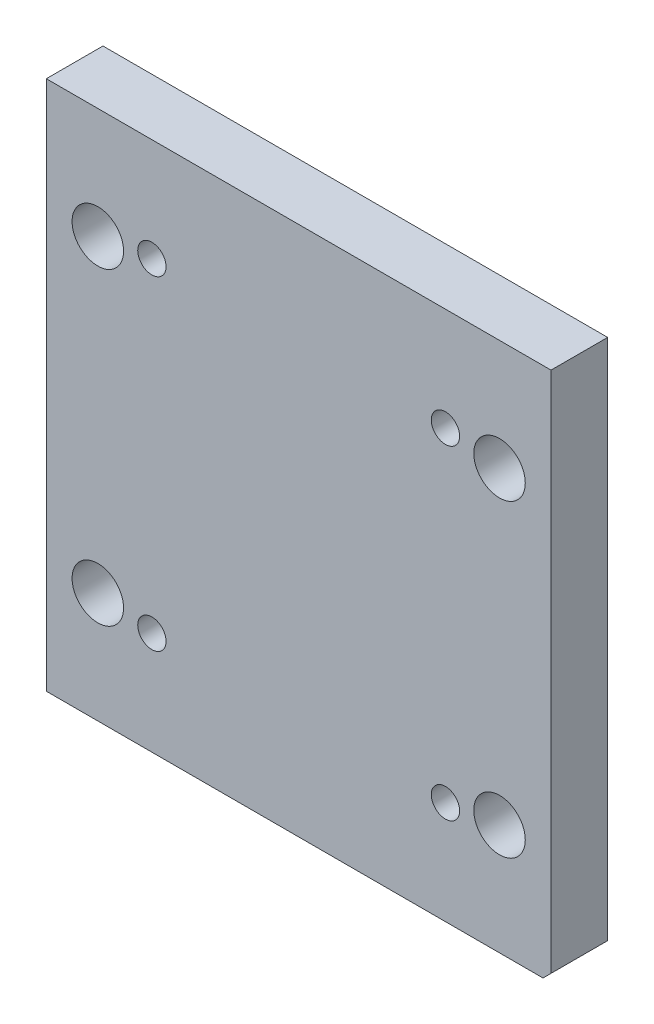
from build123d import *

# Parameters (mm, degrees)
SKETCH1_W            = 196
SKETCH1_H            = 206
BOSS_EXTRUDE1_DEPTH  = 22
DIAMETER_HOLE1_D     = 20
DIAMETER_HOLE1_DEPTH = 22
DIAMETER_HOLE1_TIP   = 6.00860619
HOLE1_D              = 11
HOLE1_CBORE_D        = 18
HOLE1_CBORE_DEPTH    = 13
SKETCH6_R            = 45
CUT_EXTRUDE1_DEPTH   = 4.05
CHAMFER1_SIZE        = 3.12


with BuildPart() as part:
    # Sketch1 → Boss-Extrude1 (new body)
    with BuildSketch(Plane.XY):
        Rectangle(SKETCH1_W, SKETCH1_H)
    extrude(amount=-BOSS_EXTRUDE1_DEPTH)

    # Diameter Hole1
    with Locations(Plane(origin=(-522.991452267, 0, 0), x_dir=(1, 0, 0), z_dir=(0, 0, 1))):
        with Locations((600.991452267, 60), (600.991452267, -60), (444.991452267, -60), (444.991452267, 60)):
            Hole(DIAMETER_HOLE1_D / 2, depth=DIAMETER_HOLE1_DEPTH)
            with Locations((0, 0, -(DIAMETER_HOLE1_DEPTH + DIAMETER_HOLE1_TIP / 2))):  # 118° drill point
                Cone(0, DIAMETER_HOLE1_D / 2, DIAMETER_HOLE1_TIP, mode=Mode.SUBTRACT)

    # Hole1 (through all)
    with Locations(Plane(origin=(0, 0, -22), x_dir=(1, 0, 0), z_dir=(0, 0, -1))):
        with Locations((57, -63), (57, 63), (-57, 63), (-57, -63)):
            CounterBoreHole(HOLE1_D / 2, HOLE1_CBORE_D / 2, HOLE1_CBORE_DEPTH)

    # Sketch6 → Cut-Extrude1 (cut)
    with BuildSketch(Plane.XY.offset(-22)):
        Circle(SKETCH6_R)
    extrude(amount=CUT_EXTRUDE1_DEPTH, mode=Mode.SUBTRACT)

    # Chamfer1
    chamfer1_edges = [part.edges().sort_by_distance(p)[0] for p in [
        (98, -103, -11),
    ]]
    chamfer(chamfer1_edges, length=CHAMFER1_SIZE)


solid = part.part
